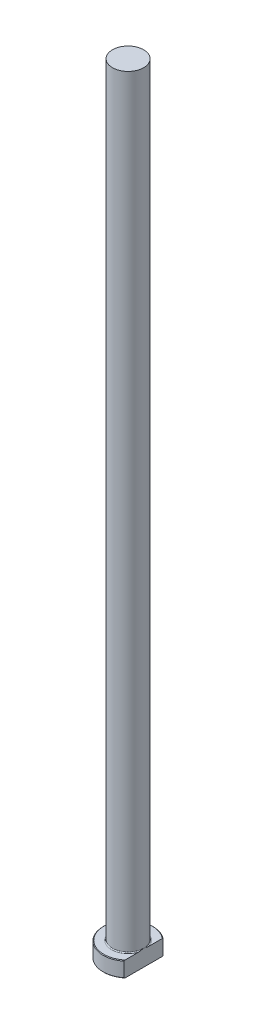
ISO-10303-21;
HEADER;
FILE_DESCRIPTION(('STEP AP214'),'2;1');
FILE_NAME('part.step','',(''),(''),'','','');
FILE_SCHEMA(('AUTOMOTIVE_DESIGN { 1 0 10303 214 1 1 1 1 }'));
ENDSEC;
DATA;
#1=APPLICATION_CONTEXT('core data for automotive mechanical design processes');
#2=APPLICATION_PROTOCOL_DEFINITION('international standard','automotive_design',2000,#1);
#3=PRODUCT_CONTEXT('',#1,'mechanical');
#4=PRODUCT('Part','Part','',(#3));
#5=PRODUCT_RELATED_PRODUCT_CATEGORY('part','',(#4));
#6=PRODUCT_DEFINITION_FORMATION('','',#4);
#7=PRODUCT_DEFINITION_CONTEXT('part definition',#1,'design');
#8=PRODUCT_DEFINITION('design','',#6,#7);
#9=PRODUCT_DEFINITION_SHAPE('','',#8);
#10=(LENGTH_UNIT() NAMED_UNIT(*) SI_UNIT(.MILLI.,.METRE.));
#11=(NAMED_UNIT(*) PLANE_ANGLE_UNIT() SI_UNIT($,.RADIAN.));
#12=(NAMED_UNIT(*) SI_UNIT($,.STERADIAN.) SOLID_ANGLE_UNIT());
#13=UNCERTAINTY_MEASURE_WITH_UNIT(LENGTH_MEASURE(1.E-05),#10,'distance_accuracy_value','');
#14=(GEOMETRIC_REPRESENTATION_CONTEXT(3) GLOBAL_UNCERTAINTY_ASSIGNED_CONTEXT((#13)) GLOBAL_UNIT_ASSIGNED_CONTEXT((#10,
#11,#12)) REPRESENTATION_CONTEXT('',''));
#15=CARTESIAN_POINT('',(0.,0.,0.));
#16=DIRECTION('',(0.,0.,1.));
#17=DIRECTION('',(1.,0.,0.));
#18=AXIS2_PLACEMENT_3D('',#15,#16,#17);
#19=CARTESIAN_POINT('',(0.,0.,0.));
#20=DIRECTION('',(0.,-1.,0.));
#21=DIRECTION('',(0.,0.,-1.));
#22=AXIS2_PLACEMENT_3D('',#19,#20,#21);
#23=PLANE('',#22);
#24=CARTESIAN_POINT('',(0.,0.,0.));
#25=DIRECTION('',(0.,-1.,0.));
#26=DIRECTION('',(0.,0.,-1.));
#27=AXIS2_PLACEMENT_3D('',#24,#25,#26);
#28=CIRCLE('',#27,7.79999999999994);
#29=CARTESIAN_POINT('',(4.99999999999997,0.,5.98665181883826));
#30=VERTEX_POINT('',#29);
#31=CARTESIAN_POINT('',(4.99999999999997,0.,-5.98665181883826));
#32=VERTEX_POINT('',#31);
#33=EDGE_CURVE('E98',#30,#32,#28,.T.);
#34=ORIENTED_EDGE('',*,*,#33,.T.);
#35=DIRECTION('',(0.,0.,1.));
#36=VECTOR('',#35,1.);
#37=CARTESIAN_POINT('',(4.99999999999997,0.,-6.24499799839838));
#38=LINE('',#37,#36);
#39=EDGE_CURVE('E83',#32,#30,#38,.T.);
#40=ORIENTED_EDGE('',*,*,#39,.T.);
#41=EDGE_LOOP('',(#34,#40));
#42=FACE_BOUND('',#41,.T.);
#43=ADVANCED_FACE('F32',(#42),#23,.T.);
#44=CARTESIAN_POINT('',(0.,259.958771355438,0.));
#45=DIRECTION('',(0.,1.,0.));
#46=DIRECTION('',(0.,0.,1.));
#47=AXIS2_PLACEMENT_3D('',#44,#45,#46);
#48=CYLINDRICAL_SURFACE('',#47,7.99999999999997);
#49=CARTESIAN_POINT('',(0.,4.80000000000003,0.));
#50=DIRECTION('',(0.,1.,0.));
#51=DIRECTION('',(0.,0.,1.));
#52=AXIS2_PLACEMENT_3D('',#49,#50,#51);
#53=CIRCLE('',#52,7.99999999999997);
#54=CARTESIAN_POINT('',(4.99999999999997,4.80000000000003,6.24499799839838));
#55=VERTEX_POINT('',#54);
#56=CARTESIAN_POINT('',(4.99999999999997,4.80000000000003,-6.24499799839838));
#57=VERTEX_POINT('',#56);
#58=EDGE_CURVE('E104',#55,#57,#53,.F.);
#59=ORIENTED_EDGE('',*,*,#58,.T.);
#60=DIRECTION('',(0.,-1.,0.));
#61=VECTOR('',#60,1.);
#62=CARTESIAN_POINT('',(4.99999999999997,250.,-6.24499799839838));
#63=LINE('',#62,#61);
#64=CARTESIAN_POINT('',(4.99999999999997,0.200000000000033,-6.24499799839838));
#65=VERTEX_POINT('',#64);
#66=EDGE_CURVE('E183',#57,#65,#63,.T.);
#67=ORIENTED_EDGE('',*,*,#66,.T.);
#68=CARTESIAN_POINT('',(0.,0.200000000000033,0.));
#69=DIRECTION('',(0.,-1.,0.));
#70=DIRECTION('',(0.,0.,-1.));
#71=AXIS2_PLACEMENT_3D('',#68,#69,#70);
#72=CIRCLE('',#71,7.99999999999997);
#73=CARTESIAN_POINT('',(4.99999999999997,0.200000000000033,6.24499799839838));
#74=VERTEX_POINT('',#73);
#75=EDGE_CURVE('E100',#65,#74,#72,.F.);
#76=ORIENTED_EDGE('',*,*,#75,.T.);
#77=DIRECTION('',(0.,-1.,0.));
#78=VECTOR('',#77,1.);
#79=CARTESIAN_POINT('',(4.99999999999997,250.,6.24499799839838));
#80=LINE('',#79,#78);
#81=EDGE_CURVE('E93',#55,#74,#80,.T.);
#82=ORIENTED_EDGE('',*,*,#81,.F.);
#83=EDGE_LOOP('',(#59,#67,#76,#82));
#84=FACE_BOUND('',#83,.T.);
#85=ADVANCED_FACE('F158',(#84),#48,.T.);
#86=CARTESIAN_POINT('',(-7.99999999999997,5.,0.));
#87=DIRECTION('',(0.,1.,0.));
#88=DIRECTION('',(0.,0.,1.));
#89=AXIS2_PLACEMENT_3D('',#86,#87,#88);
#90=PLANE('',#89);
#91=CARTESIAN_POINT('',(0.,5.,0.));
#92=DIRECTION('',(0.,1.,0.));
#93=DIRECTION('',(0.,0.,1.));
#94=AXIS2_PLACEMENT_3D('',#91,#92,#93);
#95=CIRCLE('',#94,7.79999999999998);
#96=CARTESIAN_POINT('',(4.99999999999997,5.,-5.9866518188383));
#97=VERTEX_POINT('',#96);
#98=CARTESIAN_POINT('',(4.99999999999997,5.,5.9866518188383));
#99=VERTEX_POINT('',#98);
#100=EDGE_CURVE('E178',#97,#99,#95,.T.);
#101=ORIENTED_EDGE('',*,*,#100,.T.);
#102=DIRECTION('',(0.,0.,-1.));
#103=VECTOR('',#102,1.);
#104=CARTESIAN_POINT('',(4.99999999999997,5.,0.));
#105=LINE('',#104,#103);
#106=CARTESIAN_POINT('',(4.99999999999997,4.99999999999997,1.75783958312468));
#107=VERTEX_POINT('',#106);
#108=EDGE_CURVE('E57',#99,#107,#105,.T.);
#109=ORIENTED_EDGE('',*,*,#108,.T.);
#110=CARTESIAN_POINT('',(0.,5.,0.));
#111=DIRECTION('',(0.,1.,0.));
#112=DIRECTION('',(0.,0.,1.));
#113=AXIS2_PLACEMENT_3D('',#110,#111,#112);
#114=CIRCLE('',#113,5.29999999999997);
#115=CARTESIAN_POINT('',(4.99999999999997,4.99999999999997,-1.75783958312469));
#116=VERTEX_POINT('',#115);
#117=EDGE_CURVE('E107',#107,#116,#114,.F.);
#118=ORIENTED_EDGE('',*,*,#117,.T.);
#119=EDGE_CURVE('E136',#116,#97,#105,.T.);
#120=ORIENTED_EDGE('',*,*,#119,.T.);
#121=EDGE_LOOP('',(#101,#109,#118,#120));
#122=FACE_BOUND('',#121,.T.);
#123=ADVANCED_FACE('F147',(#122),#90,.T.);
#124=CARTESIAN_POINT('',(0.,5.,0.));
#125=DIRECTION('',(0.,-1.,0.));
#126=DIRECTION('',(0.,0.,-1.));
#127=AXIS2_PLACEMENT_3D('',#124,#125,#126);
#128=CONICAL_SURFACE('',#127,7.79999999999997,0.785398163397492);
#129=ORIENTED_EDGE('',*,*,#58,.F.);
#130=CARTESIAN_POINT('',(4.99999999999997,-1.82162423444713,13.7401563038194));
#131=CARTESIAN_POINT('',(4.99999999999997,-1.61889813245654,13.5244204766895));
#132=CARTESIAN_POINT('',(4.99999999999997,-1.41646387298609,13.3084101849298));
#133=CARTESIAN_POINT('',(4.99999999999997,-1.01227657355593,12.8757508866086));
#134=CARTESIAN_POINT('',(4.99999999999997,-0.810523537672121,12.65910187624));
#135=CARTESIAN_POINT('',(4.99999999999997,-0.206157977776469,12.0077661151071));
#136=CARTESIAN_POINT('',(4.99999999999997,0.195280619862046,11.571988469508));
#137=CARTESIAN_POINT('',(4.99999999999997,1.00388282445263,10.6856136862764));
#138=CARTESIAN_POINT('',(4.99999999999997,1.41093902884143,10.234918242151));
#139=CARTESIAN_POINT('',(4.99999999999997,2.01658324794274,9.55471676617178));
#140=CARTESIAN_POINT('',(4.99999999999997,2.2175823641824,9.32735800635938));
#141=CARTESIAN_POINT('',(4.99999999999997,2.61761142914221,8.87091599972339));
#142=CARTESIAN_POINT('',(4.99999999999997,2.81664139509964,8.64183276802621));
#143=CARTESIAN_POINT('',(4.99999999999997,3.21217345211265,8.18170099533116));
#144=CARTESIAN_POINT('',(4.99999999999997,3.4086768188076,7.95065355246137));
#145=CARTESIAN_POINT('',(4.99999999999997,3.79865427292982,7.48599989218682));
#146=CARTESIAN_POINT('',(4.99999999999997,3.99212827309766,7.25239360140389));
#147=CARTESIAN_POINT('',(4.99999999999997,4.37558160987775,6.78155890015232));
#148=CARTESIAN_POINT('',(4.99999999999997,4.5655533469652,6.54432428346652));
#149=CARTESIAN_POINT('',(4.99999999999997,4.94042138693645,6.065895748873));
#150=CARTESIAN_POINT('',(4.99999999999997,5.12531810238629,5.82470215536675));
#151=CARTESIAN_POINT('',(4.99999999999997,5.48653546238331,5.33972956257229));
#152=CARTESIAN_POINT('',(4.99999999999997,5.6629239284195,5.09600137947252));
#153=CARTESIAN_POINT('',(4.99999999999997,6.00675382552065,4.60213647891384));
#154=CARTESIAN_POINT('',(4.99999999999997,6.17419169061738,4.35199726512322));
#155=CARTESIAN_POINT('',(4.99999999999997,6.49592993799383,3.84445040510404));
#156=CARTESIAN_POINT('',(4.99999999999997,6.65027272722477,3.5870701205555));
#157=CARTESIAN_POINT('',(4.99999999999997,6.86813414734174,3.19356592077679));
#158=CARTESIAN_POINT('',(4.99999999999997,6.93845533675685,3.06120993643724));
#159=CARTESIAN_POINT('',(4.99999999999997,7.07360441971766,2.7937331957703));
#160=CARTESIAN_POINT('',(4.99999999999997,7.13843319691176,2.65861288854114));
#161=CARTESIAN_POINT('',(4.99999999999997,7.26869642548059,2.3693638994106));
#162=CARTESIAN_POINT('',(4.99999999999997,7.33331212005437,2.21486278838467));
#163=CARTESIAN_POINT('',(4.99999999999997,7.45243473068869,1.90194073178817));
#164=CARTESIAN_POINT('',(4.99999999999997,7.50694001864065,1.74351915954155));
#165=CARTESIAN_POINT('',(4.99999999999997,7.60343746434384,1.42384276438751));
#166=CARTESIAN_POINT('',(4.99999999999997,7.64549910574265,1.26260921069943));
#167=CARTESIAN_POINT('',(4.99999999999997,7.71543089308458,0.937062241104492));
#168=CARTESIAN_POINT('',(4.99999999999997,7.74330266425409,0.772749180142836));
#169=CARTESIAN_POINT('',(4.99999999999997,7.78344284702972,0.439876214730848));
#170=CARTESIAN_POINT('',(4.99999999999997,7.79548961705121,0.27128901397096));
#171=CARTESIAN_POINT('',(4.99999999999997,7.80240809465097,-0.0662275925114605));
#172=CARTESIAN_POINT('',(4.99999999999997,7.79728142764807,-0.235156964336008));
#173=CARTESIAN_POINT('',(4.99999999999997,7.77017954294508,-0.572209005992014));
#174=CARTESIAN_POINT('',(4.99999999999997,7.74814735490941,-0.740327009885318));
#175=CARTESIAN_POINT('',(4.99999999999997,7.68863212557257,-1.07379849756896));
#176=CARTESIAN_POINT('',(4.99999999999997,7.65114437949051,-1.23915112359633));
#177=CARTESIAN_POINT('',(4.99999999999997,7.54734433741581,-1.62344926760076));
#178=CARTESIAN_POINT('',(4.99999999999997,7.47553580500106,-1.84089917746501));
#179=CARTESIAN_POINT('',(4.99999999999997,7.31300119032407,-2.26856946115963));
#180=CARTESIAN_POINT('',(4.99999999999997,7.22226460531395,-2.4787857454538));
#181=CARTESIAN_POINT('',(4.99999999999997,7.07492970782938,-2.79014067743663));
#182=CARTESIAN_POINT('',(4.99999999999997,7.0236227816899,-2.89384077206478));
#183=CARTESIAN_POINT('',(4.99999999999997,6.91783840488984,-3.0996162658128));
#184=CARTESIAN_POINT('',(4.99999999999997,6.86336091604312,-3.2016916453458));
#185=CARTESIAN_POINT('',(4.99999999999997,6.75169048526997,-3.40428995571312));
#186=CARTESIAN_POINT('',(4.99999999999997,6.69449856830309,-3.50481345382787));
#187=CARTESIAN_POINT('',(4.99999999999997,6.57774196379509,-3.70446206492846));
#188=CARTESIAN_POINT('',(4.99999999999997,6.51817739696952,-3.80358724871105));
#189=CARTESIAN_POINT('',(4.99999999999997,6.30853654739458,-4.1443576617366));
#190=CARTESIAN_POINT('',(4.99999999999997,6.15326588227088,-4.38281352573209));
#191=CARTESIAN_POINT('',(4.99999999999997,5.8337719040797,-4.85367607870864));
#192=CARTESIAN_POINT('',(4.99999999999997,5.66954595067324,-5.08608095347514));
#193=CARTESIAN_POINT('',(4.99999999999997,5.33431698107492,-5.54628554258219));
#194=CARTESIAN_POINT('',(4.99999999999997,5.16330740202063,-5.77408045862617));
#195=CARTESIAN_POINT('',(4.99999999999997,4.81629923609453,-6.22578157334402));
#196=CARTESIAN_POINT('',(4.99999999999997,4.64030119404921,-6.44968819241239));
#197=CARTESIAN_POINT('',(4.99999999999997,4.28368615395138,-6.89532578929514));
#198=CARTESIAN_POINT('',(4.99999999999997,4.10305289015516,-7.11704371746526));
#199=CARTESIAN_POINT('',(4.99999999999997,3.73870710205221,-7.55793799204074));
#200=CARTESIAN_POINT('',(4.99999999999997,3.55499450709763,-7.77711427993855));
#201=CARTESIAN_POINT('',(4.99999999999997,3.18521083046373,-8.21325328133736));
#202=CARTESIAN_POINT('',(4.99999999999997,2.99914113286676,-8.43021717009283));
#203=CARTESIAN_POINT('',(4.99999999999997,2.62499812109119,-8.86241167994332));
#204=CARTESIAN_POINT('',(4.99999999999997,2.43692478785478,-9.07764228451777));
#205=CARTESIAN_POINT('',(4.99999999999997,1.91463404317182,-9.67075518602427));
#206=CARTESIAN_POINT('',(4.99999999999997,1.57868086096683,-10.0471086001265));
#207=CARTESIAN_POINT('',(4.99999999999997,0.903003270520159,-10.7965122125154));
#208=CARTESIAN_POINT('',(4.99999999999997,0.563278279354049,-11.1695618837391));
#209=CARTESIAN_POINT('',(4.99999999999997,-0.116149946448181,-11.9100168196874));
#210=CARTESIAN_POINT('',(4.99999999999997,-0.455830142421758,-12.2774432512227));
#211=CARTESIAN_POINT('',(4.99999999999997,-1.13728640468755,-13.0102135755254));
#212=CARTESIAN_POINT('',(4.99999999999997,-1.47906204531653,-13.3755578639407));
#213=CARTESIAN_POINT('',(4.99999999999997,-1.82162423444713,-13.7401563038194));
#214=B_SPLINE_CURVE_WITH_KNOTS('',3,(#130,#131,#132,#133,#134,#135,#136,#137,#138,#139,#140,
#141,#142,#143,#144,#145,#146,#147,#148,#149,#150,#151,#152,#153,#154,#155,#156,#157,#158,#159,
#160,#161,#162,#163,#164,#165,#166,#167,#168,#169,#170,#171,#172,#173,#174,#175,#176,#177,#178,
#179,#180,#181,#182,#183,#184,#185,#186,#187,#188,#189,#190,#191,#192,#193,#194,#195,#196,#197,
#198,#199,#200,#201,#202,#203,#204,#205,#206,#207,#208,#209,#210,#211,#212,#213),.UNSPECIFIED.,
.F.,.F.,(4,2,2,2,2,2,2,2,2,2,2,2,2,2,2,2,2,2,2,2,2,2,2,2,2,2,2,2,2,2,2,2,2,2,2,2,2,2,2,2,2,4),
(0.,0.888120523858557,1.77624635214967,3.55372511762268,5.37559481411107,6.28598924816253,
7.19637570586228,8.10628289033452,9.01621623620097,9.92793449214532,10.8395784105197,
11.7420025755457,12.6447836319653,13.5445196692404,13.9940505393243,14.4435089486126,
14.9456212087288,15.4478142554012,15.947147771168,16.4464240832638,16.9526211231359,
17.4587702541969,17.966632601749,18.4746496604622,19.1604516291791,19.8466351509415,
20.1936870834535,20.5407431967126,20.8876692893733,21.2345777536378,22.0879097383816,
22.9414946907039,23.7959266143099,24.6502655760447,25.5081848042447,26.3661237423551,
27.2235803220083,28.0810450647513,29.5944656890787,31.1081235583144,32.6092678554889,
34.1101167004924),.UNSPECIFIED.);
#215=EDGE_CURVE('E135',#55,#99,#214,.T.);
#216=ORIENTED_EDGE('',*,*,#215,.T.);
#217=ORIENTED_EDGE('',*,*,#100,.F.);
#218=EDGE_CURVE('E127',#97,#57,#214,.T.);
#219=ORIENTED_EDGE('',*,*,#218,.T.);
#220=EDGE_LOOP('',(#129,#216,#217,#219));
#221=FACE_BOUND('',#220,.T.);
#222=ADVANCED_FACE('F143',(#221),#128,.T.);
#223=CARTESIAN_POINT('',(0.,0.200000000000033,0.));
#224=DIRECTION('',(0.,1.,0.));
#225=DIRECTION('',(0.,0.,1.));
#226=AXIS2_PLACEMENT_3D('',#223,#224,#225);
#227=CONICAL_SURFACE('',#226,7.99999999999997,0.785398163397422);
#228=ORIENTED_EDGE('',*,*,#75,.F.);
#229=CARTESIAN_POINT('',(4.99999999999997,6.8216242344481,-13.7401563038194));
#230=CARTESIAN_POINT('',(4.99999999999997,6.6188981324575,-13.5244204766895));
#231=CARTESIAN_POINT('',(4.99999999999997,6.41646387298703,-13.3084101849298));
#232=CARTESIAN_POINT('',(4.99999999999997,6.01227657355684,-12.8757508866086));
#233=CARTESIAN_POINT('',(4.99999999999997,5.81052353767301,-12.6591018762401));
#234=CARTESIAN_POINT('',(4.99999999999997,5.2061579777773,-12.0077661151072));
#235=CARTESIAN_POINT('',(4.99999999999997,4.80471938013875,-11.5719884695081));
#236=CARTESIAN_POINT('',(4.99999999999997,3.9961171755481,-10.6856136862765));
#237=CARTESIAN_POINT('',(4.99999999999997,3.58906097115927,-10.2349182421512));
#238=CARTESIAN_POINT('',(4.99999999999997,2.9834167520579,-9.55471676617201));
#239=CARTESIAN_POINT('',(4.99999999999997,2.78241763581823,-9.32735800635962));
#240=CARTESIAN_POINT('',(4.99999999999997,2.38238857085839,-8.87091599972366));
#241=CARTESIAN_POINT('',(4.99999999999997,2.18335860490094,-8.64183276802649));
#242=CARTESIAN_POINT('',(4.99999999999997,1.78782654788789,-8.18170099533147));
#243=CARTESIAN_POINT('',(4.99999999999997,1.59132318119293,-7.9506535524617));
#244=CARTESIAN_POINT('',(4.99999999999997,1.20134572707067,-7.48599989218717));
#245=CARTESIAN_POINT('',(4.99999999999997,1.00787172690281,-7.25239360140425));
#246=CARTESIAN_POINT('',(4.99999999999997,0.624418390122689,-6.78155890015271));
#247=CARTESIAN_POINT('',(4.99999999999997,0.434446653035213,-6.54432428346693));
#248=CARTESIAN_POINT('',(4.99999999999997,0.0595786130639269,-6.06589574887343));
#249=CARTESIAN_POINT('',(4.99999999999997,-0.125318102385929,-5.8247021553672));
#250=CARTESIAN_POINT('',(4.99999999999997,-0.486535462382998,-5.33972956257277));
#251=CARTESIAN_POINT('',(4.99999999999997,-0.662923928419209,-5.09600137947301));
#252=CARTESIAN_POINT('',(4.99999999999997,-1.0067538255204,-4.60213647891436));
#253=CARTESIAN_POINT('',(4.99999999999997,-1.17419169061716,-4.35199726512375));
#254=CARTESIAN_POINT('',(4.99999999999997,-1.49592993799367,-3.8444504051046));
#255=CARTESIAN_POINT('',(4.99999999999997,-1.65027272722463,-3.58707012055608));
#256=CARTESIAN_POINT('',(4.99999999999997,-1.86813414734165,-3.19356592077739));
#257=CARTESIAN_POINT('',(4.99999999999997,-1.93845533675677,-3.06120993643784));
#258=CARTESIAN_POINT('',(4.99999999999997,-2.07360441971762,-2.79373319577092));
#259=CARTESIAN_POINT('',(4.99999999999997,-2.13843319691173,-2.65861288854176));
#260=CARTESIAN_POINT('',(4.99999999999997,-2.2686964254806,-2.36936389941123));
#261=CARTESIAN_POINT('',(4.99999999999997,-2.3333121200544,-2.21486278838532));
#262=CARTESIAN_POINT('',(4.99999999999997,-2.45243473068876,-1.90194073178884));
#263=CARTESIAN_POINT('',(4.99999999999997,-2.50694001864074,-1.74351915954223));
#264=CARTESIAN_POINT('',(4.99999999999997,-2.60343746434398,-1.42384276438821));
#265=CARTESIAN_POINT('',(4.99999999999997,-2.64549910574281,-1.26260921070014));
#266=CARTESIAN_POINT('',(4.99999999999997,-2.7154308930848,-0.93706224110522));
#267=CARTESIAN_POINT('',(4.99999999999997,-2.74330266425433,-0.772749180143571));
#268=CARTESIAN_POINT('',(4.99999999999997,-2.78344284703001,-0.439876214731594));
#269=CARTESIAN_POINT('',(4.99999999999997,-2.79548961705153,-0.271289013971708));
#270=CARTESIAN_POINT('',(4.99999999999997,-2.80240809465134,0.0662275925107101));
#271=CARTESIAN_POINT('',(4.99999999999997,-2.79728142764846,0.235156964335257));
#272=CARTESIAN_POINT('',(4.99999999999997,-2.77017954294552,0.572209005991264));
#273=CARTESIAN_POINT('',(4.99999999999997,-2.74814735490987,0.740327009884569));
#274=CARTESIAN_POINT('',(4.99999999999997,-2.68863212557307,1.07379849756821));
#275=CARTESIAN_POINT('',(4.99999999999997,-2.65114437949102,1.23915112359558));
#276=CARTESIAN_POINT('',(4.99999999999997,-2.54734433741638,1.62344926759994));
#277=CARTESIAN_POINT('',(4.99999999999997,-2.47553580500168,1.84089917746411));
#278=CARTESIAN_POINT('',(4.99999999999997,-2.31300119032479,2.26856946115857));
#279=CARTESIAN_POINT('',(4.99999999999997,-2.22226460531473,2.47878574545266));
#280=CARTESIAN_POINT('',(4.99999999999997,-2.07492970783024,2.79014067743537));
#281=CARTESIAN_POINT('',(4.99999999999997,-2.02362278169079,2.89384077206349));
#282=CARTESIAN_POINT('',(4.99999999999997,-1.91783840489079,3.09961626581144));
#283=CARTESIAN_POINT('',(4.99999999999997,-1.8633609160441,3.20169164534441));
#284=CARTESIAN_POINT('',(4.99999999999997,-1.75169048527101,3.40428995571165));
#285=CARTESIAN_POINT('',(4.99999999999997,-1.69449856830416,3.50481345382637));
#286=CARTESIAN_POINT('',(4.99999999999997,-1.57774196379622,3.70446206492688));
#287=CARTESIAN_POINT('',(4.99999999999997,-1.51817739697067,3.80358724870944));
#288=CARTESIAN_POINT('',(4.99999999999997,-1.30853654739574,4.14435766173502));
#289=CARTESIAN_POINT('',(4.99999999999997,-1.15326588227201,4.38281352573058));
#290=CARTESIAN_POINT('',(4.99999999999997,-0.833771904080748,4.85367607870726));
#291=CARTESIAN_POINT('',(4.99999999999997,-0.669545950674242,5.08608095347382));
#292=CARTESIAN_POINT('',(4.99999999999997,-0.334316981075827,5.546285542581));
#293=CARTESIAN_POINT('',(4.99999999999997,-0.16330740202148,5.77408045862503));
#294=CARTESIAN_POINT('',(4.99999999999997,0.183700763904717,6.22578157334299));
#295=CARTESIAN_POINT('',(4.99999999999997,0.359698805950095,6.44968819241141));
#296=CARTESIAN_POINT('',(4.99999999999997,0.71631384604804,6.89532578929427));
#297=CARTESIAN_POINT('',(4.99999999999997,0.896947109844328,7.11704371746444));
#298=CARTESIAN_POINT('',(4.99999999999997,1.2612928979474,7.55793799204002));
#299=CARTESIAN_POINT('',(4.99999999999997,1.44500549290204,7.77711427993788));
#300=CARTESIAN_POINT('',(4.99999999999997,1.81478916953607,8.21325328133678));
#301=CARTESIAN_POINT('',(4.99999999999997,2.00085886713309,8.4302171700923));
#302=CARTESIAN_POINT('',(4.99999999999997,2.37500187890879,8.86241167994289));
#303=CARTESIAN_POINT('',(4.99999999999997,2.56307521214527,9.07764228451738));
#304=CARTESIAN_POINT('',(4.99999999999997,3.08536595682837,9.67075518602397));
#305=CARTESIAN_POINT('',(4.99999999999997,3.42131913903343,10.0471086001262));
#306=CARTESIAN_POINT('',(4.99999999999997,4.09699672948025,10.7965122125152));
#307=CARTESIAN_POINT('',(4.99999999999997,4.43672172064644,11.169561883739));
#308=CARTESIAN_POINT('',(4.99999999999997,5.11614994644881,11.9100168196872));
#309=CARTESIAN_POINT('',(4.99999999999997,5.45583014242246,12.2774432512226));
#310=CARTESIAN_POINT('',(4.99999999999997,6.13728640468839,13.0102135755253));
#311=CARTESIAN_POINT('',(4.99999999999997,6.47906204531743,13.3755578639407));
#312=CARTESIAN_POINT('',(4.99999999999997,6.8216242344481,13.7401563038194));
#313=B_SPLINE_CURVE_WITH_KNOTS('',3,(#229,#230,#231,#232,#233,#234,#235,#236,#237,#238,#239,
#240,#241,#242,#243,#244,#245,#246,#247,#248,#249,#250,#251,#252,#253,#254,#255,#256,#257,#258,
#259,#260,#261,#262,#263,#264,#265,#266,#267,#268,#269,#270,#271,#272,#273,#274,#275,#276,#277,
#278,#279,#280,#281,#282,#283,#284,#285,#286,#287,#288,#289,#290,#291,#292,#293,#294,#295,#296,
#297,#298,#299,#300,#301,#302,#303,#304,#305,#306,#307,#308,#309,#310,#311,#312),.UNSPECIFIED.,
.F.,.F.,(4,2,2,2,2,2,2,2,2,2,2,2,2,2,2,2,2,2,2,2,2,2,2,2,2,2,2,2,2,2,2,2,2,2,2,2,2,2,2,2,2,4),
(0.,0.888120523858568,1.77624635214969,3.55372511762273,5.37559481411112,6.28598924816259,
7.19637570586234,8.10628289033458,9.01621623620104,9.92793449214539,10.8395784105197,
11.7420025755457,12.6447836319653,13.5445196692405,13.9940505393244,14.4435089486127,
14.9456212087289,15.4478142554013,15.9471477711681,16.4464240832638,16.952621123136,
17.458770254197,17.9666326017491,18.4746496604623,19.1604516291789,19.846635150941,
20.1936870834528,20.5407431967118,20.8876692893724,21.2345777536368,22.0879097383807,
22.9414946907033,23.7959266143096,24.6502655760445,25.5081848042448,26.3661237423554,
27.2235803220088,28.0810450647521,29.5944656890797,31.1081235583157,32.6092678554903,
34.110116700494),.UNSPECIFIED.);
#314=EDGE_CURVE('E86',#65,#32,#313,.T.);
#315=ORIENTED_EDGE('',*,*,#314,.T.);
#316=ORIENTED_EDGE('',*,*,#33,.F.);
#317=EDGE_CURVE('E89',#30,#74,#313,.T.);
#318=ORIENTED_EDGE('',*,*,#317,.T.);
#319=EDGE_LOOP('',(#228,#315,#316,#318));
#320=FACE_BOUND('',#319,.T.);
#321=ADVANCED_FACE('F97',(#320),#227,.T.);
#322=CARTESIAN_POINT('',(0.,5.29999999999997,0.));
#323=DIRECTION('',(0.,1.,0.));
#324=DIRECTION('',(0.,0.,1.));
#325=AXIS2_PLACEMENT_3D('',#322,#323,#324);
#326=TOROIDAL_SURFACE('',#325,5.29999999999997,0.3);
#327=CARTESIAN_POINT('',(4.99999999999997,5.29999999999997,0.));
#328=CARTESIAN_POINT('',(4.99999999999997,5.30000062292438,1.31470000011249E-10));
#329=CARTESIAN_POINT('',(4.99999999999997,5.30000124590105,-2.52759208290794E-07));
#330=CARTESIAN_POINT('',(4.99999999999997,5.30000240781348,-9.4716432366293E-07));
#331=CARTESIAN_POINT('',(4.99999999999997,5.30000293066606,-1.40594035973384E-06));
#332=CARTESIAN_POINT('',(4.99999999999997,5.30000402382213,-2.50637603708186E-06));
#333=CARTESIAN_POINT('',(4.99999999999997,5.30000457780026,-3.16588904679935E-06));
#334=CARTESIAN_POINT('',(4.99999999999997,5.30000556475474,-4.52859961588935E-06));
#335=CARTESIAN_POINT('',(4.99999999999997,5.30000600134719,-5.22939444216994E-06));
#336=CARTESIAN_POINT('',(4.99999999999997,5.30000763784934,-7.96121978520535E-06));
#337=CARTESIAN_POINT('',(4.99999999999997,5.30000875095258,-1.0047740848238E-05));
#338=CARTESIAN_POINT('',(4.99999999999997,5.30001056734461,-1.41660873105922E-05));
#339=CARTESIAN_POINT('',(4.99999999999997,5.30001129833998,-1.61861783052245E-05));
#340=CARTESIAN_POINT('',(4.99999999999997,5.30001439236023,-2.47865739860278E-05));
#341=CARTESIAN_POINT('',(4.99999999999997,5.30001672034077,-3.1383028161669E-05));
#342=CARTESIAN_POINT('',(4.99999999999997,5.30002012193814,-4.38084218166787E-05));
#343=CARTESIAN_POINT('',(4.99999999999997,5.30002133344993,-4.95992736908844E-05));
#344=CARTESIAN_POINT('',(4.99999999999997,5.30003020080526,-9.27862610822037E-05));
#345=CARTESIAN_POINT('',(4.99999999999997,5.30003696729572,-0.000130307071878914));
#346=CARTESIAN_POINT('',(4.99999999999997,5.30006659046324,-0.000278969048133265));
#347=CARTESIAN_POINT('',(4.99999999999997,5.30009481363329,-0.000389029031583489));
#348=CARTESIAN_POINT('',(4.99999999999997,5.3002050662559,-0.000826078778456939));
#349=CARTESIAN_POINT('',(4.99999999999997,5.30028365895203,-0.0011536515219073));
#350=CARTESIAN_POINT('',(4.99999999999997,5.300599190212,-0.0024592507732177));
#351=CARTESIAN_POINT('',(4.99999999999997,5.30084048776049,-0.00343651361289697));
#352=CARTESIAN_POINT('',(4.99999999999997,5.3018462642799,-0.00752058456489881));
#353=CARTESIAN_POINT('',(4.99999999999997,5.3026052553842,-0.0106283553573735));
#354=CARTESIAN_POINT('',(4.99999999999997,5.30996461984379,-0.0407482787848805));
#355=CARTESIAN_POINT('',(4.99999999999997,5.31658985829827,-0.0677561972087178));
#356=CARTESIAN_POINT('',(4.99999999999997,5.32953319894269,-0.120688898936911));
#357=CARTESIAN_POINT('',(4.99999999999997,5.33585289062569,-0.146613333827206));
#358=CARTESIAN_POINT('',(4.99999999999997,5.34926050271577,-0.201795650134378));
#359=CARTESIAN_POINT('',(4.99999999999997,5.35634306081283,-0.231054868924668));
#360=CARTESIAN_POINT('',(4.99999999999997,5.37050252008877,-0.289917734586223));
#361=CARTESIAN_POINT('',(4.99999999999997,5.37757848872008,-0.319521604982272));
#362=CARTESIAN_POINT('',(4.99999999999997,5.39452602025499,-0.391032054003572));
#363=CARTESIAN_POINT('',(4.99999999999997,5.40434071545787,-0.432952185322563));
#364=CARTESIAN_POINT('',(4.99999999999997,5.42340141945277,-0.51576321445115));
#365=CARTESIAN_POINT('',(4.99999999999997,5.43265559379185,-0.556652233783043));
#366=CARTESIAN_POINT('',(4.99999999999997,5.45710553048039,-0.667075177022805));
#367=CARTESIAN_POINT('',(4.99999999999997,5.47194176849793,-0.736689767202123));
#368=CARTESIAN_POINT('',(4.99999999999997,5.50018229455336,-0.876836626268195));
#369=CARTESIAN_POINT('',(4.99999999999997,5.51357312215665,-0.947371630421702));
#370=CARTESIAN_POINT('',(4.99999999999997,5.53930921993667,-1.09497328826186));
#371=CARTESIAN_POINT('',(4.99999999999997,5.55146217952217,-1.17207432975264));
#372=CARTESIAN_POINT('',(4.99999999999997,5.57239669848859,-1.32672649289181));
#373=CARTESIAN_POINT('',(4.99999999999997,5.58117877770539,-1.40427754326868));
#374=CARTESIAN_POINT('',(4.99999999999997,5.594997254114,-1.5687382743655));
#375=CARTESIAN_POINT('',(4.99999999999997,5.59948802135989,-1.65570044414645));
#376=CARTESIAN_POINT('',(4.99999999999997,5.60018885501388,-1.78535304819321));
#377=CARTESIAN_POINT('',(4.99999999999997,5.59945214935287,-1.82802575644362));
#378=CARTESIAN_POINT('',(4.99999999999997,5.59559364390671,-1.91325081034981));
#379=CARTESIAN_POINT('',(4.99999999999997,5.59247319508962,-1.95580321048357));
#380=CARTESIAN_POINT('',(4.99999999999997,5.5838324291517,-2.03512365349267));
#381=CARTESIAN_POINT('',(4.99999999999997,5.57867386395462,-2.07192937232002));
#382=CARTESIAN_POINT('',(4.99999999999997,5.56543793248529,-2.1452675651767));
#383=CARTESIAN_POINT('',(4.99999999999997,5.55734203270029,-2.18179676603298));
#384=CARTESIAN_POINT('',(4.99999999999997,5.53718005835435,-2.25427226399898));
#385=CARTESIAN_POINT('',(4.99999999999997,5.52507057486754,-2.29020746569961));
#386=CARTESIAN_POINT('',(4.99999999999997,5.50270928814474,-2.34223029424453));
#387=CARTESIAN_POINT('',(4.99999999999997,5.4945781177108,-2.35922314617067));
#388=CARTESIAN_POINT('',(4.99999999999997,5.47657809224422,-2.39224900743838));
#389=CARTESIAN_POINT('',(4.99999999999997,5.46671281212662,-2.40828390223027));
#390=CARTESIAN_POINT('',(4.99999999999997,5.44695893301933,-2.43579467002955));
#391=CARTESIAN_POINT('',(4.99999999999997,5.4374587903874,-2.44754592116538));
#392=CARTESIAN_POINT('',(4.99999999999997,5.41677914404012,-2.46946476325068));
#393=CARTESIAN_POINT('',(4.99999999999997,5.40560543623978,-2.47963758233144));
#394=CARTESIAN_POINT('',(4.99999999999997,5.38617750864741,-2.49393642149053));
#395=CARTESIAN_POINT('',(4.99999999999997,5.37851643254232,-2.49886271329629));
#396=CARTESIAN_POINT('',(4.99999999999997,5.36252740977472,-2.50749953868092));
#397=CARTESIAN_POINT('',(4.99999999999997,5.35419984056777,-2.51121075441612));
#398=CARTESIAN_POINT('',(4.99999999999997,5.33690648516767,-2.51712941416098));
#399=CARTESIAN_POINT('',(4.99999999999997,5.3279345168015,-2.51931927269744));
#400=CARTESIAN_POINT('',(4.99999999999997,5.30973576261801,-2.52185978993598));
#401=CARTESIAN_POINT('',(4.99999999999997,5.30050931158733,-2.52221275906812));
#402=CARTESIAN_POINT('',(4.99999999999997,5.28349166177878,-2.52112455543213));
#403=CARTESIAN_POINT('',(4.99999999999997,5.27568322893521,-2.519931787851));
#404=CARTESIAN_POINT('',(4.99999999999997,5.26036860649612,-2.51628294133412));
#405=CARTESIAN_POINT('',(4.99999999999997,5.25286261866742,-2.51382603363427));
#406=CARTESIAN_POINT('',(4.99999999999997,5.23590266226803,-2.50685484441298));
#407=CARTESIAN_POINT('',(4.99999999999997,5.22661875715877,-2.50192984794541));
#408=CARTESIAN_POINT('',(4.99999999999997,5.20895514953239,-2.49066548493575));
#409=CARTESIAN_POINT('',(4.99999999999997,5.20057756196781,-2.48432291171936));
#410=CARTESIAN_POINT('',(4.99999999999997,5.1798700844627,-2.46645212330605));
#411=CARTESIAN_POINT('',(4.99999999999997,5.1682415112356,-2.45411867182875));
#412=CARTESIAN_POINT('',(4.99999999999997,5.14692461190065,-2.42790849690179));
#413=CARTESIAN_POINT('',(4.99999999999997,5.13723987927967,-2.41402898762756));
#414=CARTESIAN_POINT('',(4.99999999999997,5.11080706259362,-2.37143175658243));
#415=CARTESIAN_POINT('',(4.99999999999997,5.09628770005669,-2.34134703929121));
#416=CARTESIAN_POINT('',(4.99999999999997,5.07130349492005,-2.27940731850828));
#417=CARTESIAN_POINT('',(4.99999999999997,5.06087110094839,-2.24754035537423));
#418=CARTESIAN_POINT('',(4.99999999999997,5.03890359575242,-2.16787245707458));
#419=CARTESIAN_POINT('',(4.99999999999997,5.02913523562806,-2.1195906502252));
#420=CARTESIAN_POINT('',(4.99999999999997,5.01416953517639,-2.02224928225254));
#421=CARTESIAN_POINT('',(4.99999999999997,5.00898637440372,-1.97318778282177));
#422=CARTESIAN_POINT('',(4.99999999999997,5.00220823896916,-1.87635767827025));
#423=CARTESIAN_POINT('',(4.99999999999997,5.00050709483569,-1.82859609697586));
#424=CARTESIAN_POINT('',(4.99999999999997,4.99969104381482,-1.73330165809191));
#425=CARTESIAN_POINT('',(4.99999999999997,5.00056327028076,-1.68576884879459));
#426=CARTESIAN_POINT('',(4.99999999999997,5.0048429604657,-1.57937770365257));
#427=CARTESIAN_POINT('',(4.99999999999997,5.00880932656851,-1.52054285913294));
#428=CARTESIAN_POINT('',(4.99999999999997,5.01925964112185,-1.40312974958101));
#429=CARTESIAN_POINT('',(4.99999999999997,5.02574264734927,-1.34455139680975));
#430=CARTESIAN_POINT('',(4.99999999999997,5.04090087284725,-1.22627662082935));
#431=CARTESIAN_POINT('',(4.99999999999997,5.0496242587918,-1.16658647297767));
#432=CARTESIAN_POINT('',(4.99999999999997,5.06877923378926,-1.04732463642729));
#433=CARTESIAN_POINT('',(4.99999999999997,5.07921523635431,-0.987753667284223));
#434=CARTESIAN_POINT('',(4.99999999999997,5.10551698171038,-0.846936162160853));
#435=CARTESIAN_POINT('',(4.99999999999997,5.12196565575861,-0.765799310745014));
#436=CARTESIAN_POINT('',(4.99999999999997,5.15639716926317,-0.604819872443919));
#437=CARTESIAN_POINT('',(4.99999999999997,5.17436050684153,-0.524973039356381));
#438=CARTESIAN_POINT('',(4.99999999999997,5.20921667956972,-0.374726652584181));
#439=CARTESIAN_POINT('',(4.99999999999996,5.22599388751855,-0.304300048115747));
#440=CARTESIAN_POINT('',(4.99999999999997,5.2519110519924,-0.196907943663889));
#441=CARTESIAN_POINT('',(4.99999999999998,5.26090146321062,-0.159905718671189));
#442=CARTESIAN_POINT('',(4.99999999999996,5.27881854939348,-0.0865164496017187));
#443=CARTESIAN_POINT('',(4.99999999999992,5.28774391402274,-0.0501291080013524));
#444=CARTESIAN_POINT('',(4.99999999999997,5.29739627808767,-0.0106218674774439));
#445=CARTESIAN_POINT('',(4.99999999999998,5.2981568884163,-0.00750762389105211));
#446=CARTESIAN_POINT('',(4.99999999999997,5.2991630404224,-0.00342209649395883));
#447=CARTESIAN_POINT('',(4.99999999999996,5.29940309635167,-0.00244985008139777));
#448=CARTESIAN_POINT('',(4.99999999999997,5.29971711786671,-0.00115049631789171));
#449=CARTESIAN_POINT('',(4.99999999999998,5.299795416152,-0.000824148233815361));
#450=CARTESIAN_POINT('',(4.99999999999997,5.2999053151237,-0.000388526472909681));
#451=CARTESIAN_POINT('',(4.99999999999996,5.29993348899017,-0.0002786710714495));
#452=CARTESIAN_POINT('',(4.99999999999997,5.29996306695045,-0.000130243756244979));
#453=CARTESIAN_POINT('',(4.99999999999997,5.29996982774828,-9.2751137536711E-05));
#454=CARTESIAN_POINT('',(4.99999999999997,5.29997868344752,-4.95929887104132E-05));
#455=CARTESIAN_POINT('',(4.99999999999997,5.29997989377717,-4.38036553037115E-05));
#456=CARTESIAN_POINT('',(4.99999999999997,5.29998329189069,-3.13814183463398E-05));
#457=CARTESIAN_POINT('',(4.99999999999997,5.29998561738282,-2.4786521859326E-05));
#458=CARTESIAN_POINT('',(4.99999999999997,5.29998870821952,-1.61877546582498E-05));
#459=CARTESIAN_POINT('',(4.99999999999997,5.29998943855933,-1.41677768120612E-05));
#460=CARTESIAN_POINT('',(4.99999999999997,5.29999125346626,-1.00495530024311E-05));
#461=CARTESIAN_POINT('',(4.99999999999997,5.29999236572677,-7.96302653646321E-06));
#462=CARTESIAN_POINT('',(4.99999999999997,5.29999400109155,-5.23107415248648E-06));
#463=CARTESIAN_POINT('',(4.99999999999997,5.29999443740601,-4.53021031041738E-06));
#464=CARTESIAN_POINT('',(4.99999999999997,5.29999542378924,-3.16731152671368E-06));
#465=CARTESIAN_POINT('',(4.99999999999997,5.29999597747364,-2.50767725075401E-06));
#466=CARTESIAN_POINT('',(4.99999999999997,5.29999707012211,-1.40695877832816E-06));
#467=CARTESIAN_POINT('',(4.99999999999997,5.29999759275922,-9.48032431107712E-07));
#468=CARTESIAN_POINT('',(4.99999999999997,5.29999875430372,-2.53244317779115E-07));
#469=CARTESIAN_POINT('',(4.99999999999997,5.29999937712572,-1.3145941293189E-10));
#470=CARTESIAN_POINT('',(4.99999999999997,5.29999999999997,0.));
#471=B_SPLINE_CURVE_WITH_KNOTS('',3,(#327,#328,#329,#330,#331,#332,#333,#334,#335,#336,#337,
#338,#339,#340,#341,#342,#343,#344,#345,#346,#347,#348,#349,#350,#351,#352,#353,#354,#355,#356,
#357,#358,#359,#360,#361,#362,#363,#364,#365,#366,#367,#368,#369,#370,#371,#372,#373,#374,#375,
#376,#377,#378,#379,#380,#381,#382,#383,#384,#385,#386,#387,#388,#389,#390,#391,#392,#393,#394,
#395,#396,#397,#398,#399,#400,#401,#402,#403,#404,#405,#406,#407,#408,#409,#410,#411,#412,#413,
#414,#415,#416,#417,#418,#419,#420,#421,#422,#423,#424,#425,#426,#427,#428,#429,#430,#431,#432,
#433,#434,#435,#436,#437,#438,#439,#440,#441,#442,#443,#444,#445,#446,#447,#448,#449,#450,#451,
#452,#453,#454,#455,#456,#457,#458,#459,#460,#461,#462,#463,#464,#465,#466,#467,#468,#469,#470),
.UNSPECIFIED.,.T.,.F.,(4,2,2,2,2,2,2,2,2,2,2,2,2,2,2,2,2,2,2,2,2,2,2,2,2,2,2,2,2,2,2,2,2,2,2,2,
2,2,2,2,2,2,2,2,2,2,2,2,2,2,2,2,2,2,2,2,2,2,2,2,2,2,2,2,2,2,2,2,2,2,2,4),(0.,
1.88939317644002E-06,3.98058917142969E-06,6.54818564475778E-06,9.0240439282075E-06,
1.60938750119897E-05,2.25328198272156E-05,4.34843921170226E-05,6.12120199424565E-05,
0.000175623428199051,0.000516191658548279,0.00152710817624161,0.00454656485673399,
0.0141443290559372,0.0975679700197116,0.177619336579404,0.267931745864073,0.35924502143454,
0.488405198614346,0.614173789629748,0.827694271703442,1.04305715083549,1.27715608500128,
1.51121890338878,1.77214751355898,1.9001350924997,2.02805018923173,2.13945459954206,
2.25157451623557,2.36494894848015,2.4213923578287,2.47772074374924,2.52293802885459,
2.56800219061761,2.59524342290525,2.62246933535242,2.65000494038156,2.67750590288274,
2.70108948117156,2.72468854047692,2.75603978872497,2.78746268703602,2.83802806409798,
2.888686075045,2.98834295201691,3.0887757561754,3.23618650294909,3.38405153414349,
3.52733651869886,3.66990630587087,3.84673903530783,4.02350562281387,4.20444776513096,
4.38586374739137,4.63419556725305,4.87971270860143,5.09690175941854,5.21113882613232,
5.32353360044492,5.33315137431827,5.33615533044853,5.33716246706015,5.33750240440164,
5.33761672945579,5.33763445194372,5.33765539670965,5.33766183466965,5.33766890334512,
5.33767137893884,5.3376739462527,5.33767603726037,5.3376779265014),.UNSPECIFIED.);
#472=CARTESIAN_POINT('',(4.99999999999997,5.29999999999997,0.));
#473=VERTEX_POINT('',#472);
#474=EDGE_CURVE('E11',#116,#473,#471,.T.);
#475=ORIENTED_EDGE('',*,*,#474,.F.);
#476=ORIENTED_EDGE('',*,*,#117,.F.);
#477=CARTESIAN_POINT('',(4.99999999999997,5.29999999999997,0.));
#478=CARTESIAN_POINT('',(4.99999999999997,5.29999937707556,-1.31470067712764E-10));
#479=CARTESIAN_POINT('',(4.99999999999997,5.29999875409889,2.5275920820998E-07));
#480=CARTESIAN_POINT('',(4.99999999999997,5.29999759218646,9.4716432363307E-07));
#481=CARTESIAN_POINT('',(4.99999999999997,5.29999706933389,1.40594035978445E-06));
#482=CARTESIAN_POINT('',(4.99999999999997,5.29999597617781,2.5063760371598E-06));
#483=CARTESIAN_POINT('',(4.99999999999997,5.29999542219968,3.16588904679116E-06));
#484=CARTESIAN_POINT('',(4.99999999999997,5.2999944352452,4.52859961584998E-06));
#485=CARTESIAN_POINT('',(4.99999999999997,5.29999399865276,5.22939444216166E-06));
#486=CARTESIAN_POINT('',(4.99999999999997,5.2999923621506,7.96121978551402E-06));
#487=CARTESIAN_POINT('',(4.99999999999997,5.29999124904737,1.00477408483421E-05));
#488=CARTESIAN_POINT('',(4.99999999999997,5.29998943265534,1.41660873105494E-05));
#489=CARTESIAN_POINT('',(4.99999999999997,5.29998870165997,1.61861783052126E-05));
#490=CARTESIAN_POINT('',(4.99999999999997,5.29998560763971,2.47865739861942E-05));
#491=CARTESIAN_POINT('',(4.99999999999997,5.29998327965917,3.13830281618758E-05));
#492=CARTESIAN_POINT('',(4.99999999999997,5.2999798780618,4.38084218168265E-05));
#493=CARTESIAN_POINT('',(4.99999999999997,5.29997866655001,4.95992736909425E-05));
#494=CARTESIAN_POINT('',(4.99999999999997,5.29996979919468,9.27862610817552E-05));
#495=CARTESIAN_POINT('',(4.99999999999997,5.29996303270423,0.000130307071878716));
#496=CARTESIAN_POINT('',(4.99999999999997,5.2999334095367,0.000278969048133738));
#497=CARTESIAN_POINT('',(4.99999999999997,5.29990518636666,0.000389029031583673));
#498=CARTESIAN_POINT('',(4.99999999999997,5.29979493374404,0.000826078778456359));
#499=CARTESIAN_POINT('',(4.99999999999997,5.29971634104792,0.00115365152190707));
#500=CARTESIAN_POINT('',(4.99999999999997,5.29940080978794,0.00245925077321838));
#501=CARTESIAN_POINT('',(4.99999999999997,5.29915951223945,0.00343651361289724));
#502=CARTESIAN_POINT('',(4.99999999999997,5.29815373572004,0.00752058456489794));
#503=CARTESIAN_POINT('',(4.99999999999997,5.29739474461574,0.0106283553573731));
#504=CARTESIAN_POINT('',(4.99999999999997,5.29003538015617,0.040748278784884));
#505=CARTESIAN_POINT('',(4.99999999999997,5.28341014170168,0.0677561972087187));
#506=CARTESIAN_POINT('',(4.99999999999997,5.27046680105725,0.12068889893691));
#507=CARTESIAN_POINT('',(4.99999999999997,5.26414710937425,0.146613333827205));
#508=CARTESIAN_POINT('',(4.99999999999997,5.25073949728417,0.201795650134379));
#509=CARTESIAN_POINT('',(4.99999999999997,5.24365693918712,0.231054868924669));
#510=CARTESIAN_POINT('',(4.99999999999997,5.22949747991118,0.289917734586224));
#511=CARTESIAN_POINT('',(4.99999999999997,5.22242151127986,0.319521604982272));
#512=CARTESIAN_POINT('',(4.99999999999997,5.20547397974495,0.391032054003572));
#513=CARTESIAN_POINT('',(4.99999999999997,5.19565928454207,0.432952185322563));
#514=CARTESIAN_POINT('',(4.99999999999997,5.17659858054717,0.51576321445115));
#515=CARTESIAN_POINT('',(4.99999999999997,5.16734440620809,0.556652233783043));
#516=CARTESIAN_POINT('',(4.99999999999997,5.14289446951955,0.667075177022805));
#517=CARTESIAN_POINT('',(4.99999999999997,5.12805823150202,0.736689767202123));
#518=CARTESIAN_POINT('',(4.99999999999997,5.09981770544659,0.876836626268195));
#519=CARTESIAN_POINT('',(4.99999999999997,5.08642687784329,0.947371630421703));
#520=CARTESIAN_POINT('',(4.99999999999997,5.06069078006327,1.09497328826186));
#521=CARTESIAN_POINT('',(4.99999999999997,5.04853782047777,1.17207432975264));
#522=CARTESIAN_POINT('',(4.99999999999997,5.02760330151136,1.32672649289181));
#523=CARTESIAN_POINT('',(4.99999999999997,5.01882122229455,1.40427754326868));
#524=CARTESIAN_POINT('',(4.99999999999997,5.00500274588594,1.5687382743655));
#525=CARTESIAN_POINT('',(4.99999999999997,5.00051197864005,1.65570044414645));
#526=CARTESIAN_POINT('',(4.99999999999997,4.99981114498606,1.78535304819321));
#527=CARTESIAN_POINT('',(4.99999999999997,5.00054785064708,1.82802575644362));
#528=CARTESIAN_POINT('',(4.99999999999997,5.00440635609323,1.91325081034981));
#529=CARTESIAN_POINT('',(4.99999999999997,5.00752680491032,1.95580321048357));
#530=CARTESIAN_POINT('',(4.99999999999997,5.01616757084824,2.03512365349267));
#531=CARTESIAN_POINT('',(4.99999999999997,5.02132613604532,2.07192937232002));
#532=CARTESIAN_POINT('',(4.99999999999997,5.03456206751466,2.1452675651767));
#533=CARTESIAN_POINT('',(4.99999999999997,5.04265796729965,2.18179676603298));
#534=CARTESIAN_POINT('',(4.99999999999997,5.0628199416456,2.25427226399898));
#535=CARTESIAN_POINT('',(4.99999999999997,5.0749294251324,2.29020746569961));
#536=CARTESIAN_POINT('',(4.99999999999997,5.09729071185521,2.34223029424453));
#537=CARTESIAN_POINT('',(4.99999999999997,5.10542188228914,2.35922314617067));
#538=CARTESIAN_POINT('',(4.99999999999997,5.12342190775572,2.39224900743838));
#539=CARTESIAN_POINT('',(4.99999999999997,5.13328718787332,2.40828390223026));
#540=CARTESIAN_POINT('',(4.99999999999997,5.15304106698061,2.43579467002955));
#541=CARTESIAN_POINT('',(4.99999999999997,5.16254120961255,2.44754592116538));
#542=CARTESIAN_POINT('',(4.99999999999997,5.18322085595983,2.46946476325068));
#543=CARTESIAN_POINT('',(4.99999999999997,5.19439456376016,2.47963758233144));
#544=CARTESIAN_POINT('',(4.99999999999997,5.21382249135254,2.49393642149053));
#545=CARTESIAN_POINT('',(4.99999999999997,5.22148356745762,2.49886271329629));
#546=CARTESIAN_POINT('',(4.99999999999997,5.23747259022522,2.50749953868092));
#547=CARTESIAN_POINT('',(4.99999999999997,5.24580015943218,2.51121075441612));
#548=CARTESIAN_POINT('',(4.99999999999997,5.26309351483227,2.51712941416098));
#549=CARTESIAN_POINT('',(4.99999999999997,5.27206548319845,2.51931927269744));
#550=CARTESIAN_POINT('',(4.99999999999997,5.29026423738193,2.52185978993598));
#551=CARTESIAN_POINT('',(4.99999999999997,5.29949068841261,2.52221275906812));
#552=CARTESIAN_POINT('',(4.99999999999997,5.31650833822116,2.52112455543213));
#553=CARTESIAN_POINT('',(4.99999999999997,5.32431677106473,2.519931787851));
#554=CARTESIAN_POINT('',(4.99999999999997,5.33963139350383,2.51628294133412));
#555=CARTESIAN_POINT('',(4.99999999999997,5.34713738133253,2.51382603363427));
#556=CARTESIAN_POINT('',(4.99999999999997,5.36409733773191,2.50685484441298));
#557=CARTESIAN_POINT('',(4.99999999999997,5.37338124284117,2.50192984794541));
#558=CARTESIAN_POINT('',(4.99999999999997,5.39104485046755,2.49066548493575));
#559=CARTESIAN_POINT('',(4.99999999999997,5.39942243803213,2.48432291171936));
#560=CARTESIAN_POINT('',(4.99999999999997,5.42012991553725,2.46645212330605));
#561=CARTESIAN_POINT('',(4.99999999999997,5.43175848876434,2.45411867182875));
#562=CARTESIAN_POINT('',(4.99999999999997,5.45307538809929,2.42790849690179));
#563=CARTESIAN_POINT('',(4.99999999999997,5.46276012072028,2.41402898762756));
#564=CARTESIAN_POINT('',(4.99999999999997,5.48919293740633,2.37143175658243));
#565=CARTESIAN_POINT('',(4.99999999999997,5.50371229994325,2.34134703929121));
#566=CARTESIAN_POINT('',(4.99999999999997,5.52869650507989,2.27940731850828));
#567=CARTESIAN_POINT('',(4.99999999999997,5.53912889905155,2.24754035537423));
#568=CARTESIAN_POINT('',(4.99999999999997,5.56109640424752,2.16787245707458));
#569=CARTESIAN_POINT('',(4.99999999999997,5.57086476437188,2.1195906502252));
#570=CARTESIAN_POINT('',(4.99999999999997,5.58583046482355,2.02224928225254));
#571=CARTESIAN_POINT('',(4.99999999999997,5.59101362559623,1.97318778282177));
#572=CARTESIAN_POINT('',(4.99999999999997,5.59779176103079,1.87635767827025));
#573=CARTESIAN_POINT('',(4.99999999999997,5.59949290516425,1.82859609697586));
#574=CARTESIAN_POINT('',(4.99999999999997,5.60030895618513,1.73330165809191));
#575=CARTESIAN_POINT('',(4.99999999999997,5.59943672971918,1.68576884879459));
#576=CARTESIAN_POINT('',(4.99999999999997,5.59515703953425,1.57937770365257));
#577=CARTESIAN_POINT('',(4.99999999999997,5.59119067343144,1.52054285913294));
#578=CARTESIAN_POINT('',(4.99999999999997,5.5807403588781,1.40312974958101));
#579=CARTESIAN_POINT('',(4.99999999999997,5.57425735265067,1.34455139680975));
#580=CARTESIAN_POINT('',(4.99999999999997,5.5590991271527,1.22627662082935));
#581=CARTESIAN_POINT('',(4.99999999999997,5.55037574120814,1.16658647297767));
#582=CARTESIAN_POINT('',(4.99999999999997,5.53122076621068,1.04732463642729));
#583=CARTESIAN_POINT('',(4.99999999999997,5.52078476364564,0.987753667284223));
#584=CARTESIAN_POINT('',(4.99999999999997,5.49448301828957,0.846936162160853));
#585=CARTESIAN_POINT('',(4.99999999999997,5.47803434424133,0.765799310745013));
#586=CARTESIAN_POINT('',(4.99999999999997,5.44360283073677,0.604819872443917));
#587=CARTESIAN_POINT('',(4.99999999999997,5.42563949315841,0.52497303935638));
#588=CARTESIAN_POINT('',(4.99999999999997,5.39078332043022,0.374726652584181));
#589=CARTESIAN_POINT('',(4.99999999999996,5.37400611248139,0.304300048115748));
#590=CARTESIAN_POINT('',(4.99999999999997,5.34808894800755,0.19690794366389));
#591=CARTESIAN_POINT('',(4.99999999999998,5.33909853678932,0.159905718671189));
#592=CARTESIAN_POINT('',(4.99999999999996,5.32118145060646,0.0865164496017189));
#593=CARTESIAN_POINT('',(4.99999999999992,5.31225608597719,0.0501291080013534));
#594=CARTESIAN_POINT('',(4.99999999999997,5.30260372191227,0.0106218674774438));
#595=CARTESIAN_POINT('',(4.99999999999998,5.30184311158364,0.00750762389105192));
#596=CARTESIAN_POINT('',(4.99999999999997,5.30083695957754,0.00342209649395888));
#597=CARTESIAN_POINT('',(4.99999999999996,5.30059690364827,0.00244985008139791));
#598=CARTESIAN_POINT('',(4.99999999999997,5.30028288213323,0.00115049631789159));
#599=CARTESIAN_POINT('',(4.99999999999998,5.30020458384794,0.000824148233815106));
#600=CARTESIAN_POINT('',(4.99999999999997,5.30009468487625,0.000388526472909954));
#601=CARTESIAN_POINT('',(4.99999999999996,5.30006651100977,0.000278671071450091));
#602=CARTESIAN_POINT('',(4.99999999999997,5.30003693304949,0.000130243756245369));
#603=CARTESIAN_POINT('',(4.99999999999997,5.30003017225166,9.27511375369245E-05));
#604=CARTESIAN_POINT('',(4.99999999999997,5.30002131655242,4.95929887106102E-05));
#605=CARTESIAN_POINT('',(4.99999999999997,5.30002010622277,4.38036553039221E-05));
#606=CARTESIAN_POINT('',(4.99999999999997,5.30001670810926,3.13814183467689E-05));
#607=CARTESIAN_POINT('',(4.99999999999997,5.30001438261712,2.47865218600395E-05));
#608=CARTESIAN_POINT('',(4.99999999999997,5.30001129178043,1.61877546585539E-05));
#609=CARTESIAN_POINT('',(4.99999999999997,5.30001056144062,1.41677768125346E-05));
#610=CARTESIAN_POINT('',(4.99999999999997,5.30000874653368,1.00495530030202E-05));
#611=CARTESIAN_POINT('',(4.99999999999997,5.30000763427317,7.96302653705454E-06));
#612=CARTESIAN_POINT('',(4.99999999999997,5.30000599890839,5.23107415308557E-06));
#613=CARTESIAN_POINT('',(4.99999999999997,5.30000556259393,4.53021031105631E-06));
#614=CARTESIAN_POINT('',(4.99999999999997,5.30000457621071,3.16731152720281E-06));
#615=CARTESIAN_POINT('',(4.99999999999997,5.3000040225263,2.50767725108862E-06));
#616=CARTESIAN_POINT('',(4.99999999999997,5.30000292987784,1.40695877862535E-06));
#617=CARTESIAN_POINT('',(4.99999999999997,5.30000240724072,9.48032431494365E-07));
#618=CARTESIAN_POINT('',(4.99999999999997,5.30000124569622,2.53244318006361E-07));
#619=CARTESIAN_POINT('',(4.99999999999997,5.30000062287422,1.31459480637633E-10));
#620=CARTESIAN_POINT('',(4.99999999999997,5.29999999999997,0.));
#621=B_SPLINE_CURVE_WITH_KNOTS('',3,(#477,#478,#479,#480,#481,#482,#483,#484,#485,#486,#487,
#488,#489,#490,#491,#492,#493,#494,#495,#496,#497,#498,#499,#500,#501,#502,#503,#504,#505,#506,
#507,#508,#509,#510,#511,#512,#513,#514,#515,#516,#517,#518,#519,#520,#521,#522,#523,#524,#525,
#526,#527,#528,#529,#530,#531,#532,#533,#534,#535,#536,#537,#538,#539,#540,#541,#542,#543,#544,
#545,#546,#547,#548,#549,#550,#551,#552,#553,#554,#555,#556,#557,#558,#559,#560,#561,#562,#563,
#564,#565,#566,#567,#568,#569,#570,#571,#572,#573,#574,#575,#576,#577,#578,#579,#580,#581,#582,
#583,#584,#585,#586,#587,#588,#589,#590,#591,#592,#593,#594,#595,#596,#597,#598,#599,#600,#601,
#602,#603,#604,#605,#606,#607,#608,#609,#610,#611,#612,#613,#614,#615,#616,#617,#618,#619,#620),
.UNSPECIFIED.,.T.,.F.,(4,2,2,2,2,2,2,2,2,2,2,2,2,2,2,2,2,2,2,2,2,2,2,2,2,2,2,2,2,2,2,2,2,2,2,2,
2,2,2,2,2,2,2,2,2,2,2,2,2,2,2,2,2,2,2,2,2,2,2,2,2,2,2,2,2,2,2,2,2,2,2,4),(0.,
1.8893931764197E-06,3.98058917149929E-06,6.54818564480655E-06,9.02404392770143E-06,
1.60938750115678E-05,2.25328198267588E-05,4.34843921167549E-05,6.12120199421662E-05,
0.000175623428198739,0.000516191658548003,0.00152710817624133,0.00454656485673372,
0.014144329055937,0.0975679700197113,0.177619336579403,0.267931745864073,0.35924502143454,
0.488405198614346,0.614173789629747,0.827694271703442,1.04305715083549,1.27715608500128,
1.51121890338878,1.77214751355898,1.9001350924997,2.02805018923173,2.13945459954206,
2.25157451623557,2.36494894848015,2.4213923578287,2.47772074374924,2.52293802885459,
2.56800219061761,2.59524342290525,2.62246933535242,2.65000494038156,2.67750590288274,
2.70108948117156,2.72468854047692,2.75603978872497,2.78746268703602,2.83802806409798,
2.888686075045,2.98834295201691,3.0887757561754,3.23618650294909,3.38405153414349,
3.52733651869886,3.66990630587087,3.84673903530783,4.02350562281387,4.20444776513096,
4.38586374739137,4.63419556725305,4.87971270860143,5.09690175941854,5.21113882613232,
5.32353360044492,5.33315137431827,5.33615533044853,5.33716246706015,5.33750240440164,
5.33761672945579,5.33763445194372,5.33765539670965,5.33766183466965,5.33766890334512,
5.33767137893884,5.3376739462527,5.33767603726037,5.3376779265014),.UNSPECIFIED.);
#622=EDGE_CURVE('E46',#473,#107,#621,.T.);
#623=ORIENTED_EDGE('',*,*,#622,.F.);
#624=CARTESIAN_POINT('',(0.,5.29999999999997,0.));
#625=DIRECTION('',(0.,1.,0.));
#626=DIRECTION('',(0.,0.,1.));
#627=AXIS2_PLACEMENT_3D('',#624,#625,#626);
#628=CIRCLE('',#627,4.99999999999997);
#629=EDGE_CURVE('E103',#473,#473,#628,.T.);
#630=ORIENTED_EDGE('',*,*,#629,.F.);
#631=EDGE_LOOP('',(#475,#476,#623,#630));
#632=FACE_BOUND('',#631,.T.);
#633=ADVANCED_FACE('F34',(#632),#326,.F.);
#634=CARTESIAN_POINT('',(0.,259.958771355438,0.));
#635=DIRECTION('',(0.,1.,0.));
#636=DIRECTION('',(0.,0.,1.));
#637=AXIS2_PLACEMENT_3D('',#634,#635,#636);
#638=CYLINDRICAL_SURFACE('',#637,4.99999999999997);
#639=ORIENTED_EDGE('',*,*,#629,.T.);
#640=EDGE_LOOP('',(#639));
#641=FACE_BOUND('',#640,.T.);
#642=CARTESIAN_POINT('',(0.,250.,0.));
#643=DIRECTION('',(0.,1.,0.));
#644=DIRECTION('',(0.,0.,1.));
#645=AXIS2_PLACEMENT_3D('',#642,#643,#644);
#646=CIRCLE('',#645,4.99999999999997);
#647=CARTESIAN_POINT('',(0.,250.,4.99999999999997));
#648=VERTEX_POINT('',#647);
#649=EDGE_CURVE('E101',#648,#648,#646,.T.);
#650=ORIENTED_EDGE('',*,*,#649,.F.);
#651=EDGE_LOOP('',(#650));
#652=FACE_BOUND('',#651,.T.);
#653=ADVANCED_FACE('F155',(#641,#652),#638,.T.);
#654=CARTESIAN_POINT('',(-4.99999999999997,250.,0.));
#655=DIRECTION('',(0.,1.,0.));
#656=DIRECTION('',(0.,0.,1.));
#657=AXIS2_PLACEMENT_3D('',#654,#655,#656);
#658=PLANE('',#657);
#659=ORIENTED_EDGE('',*,*,#649,.T.);
#660=EDGE_LOOP('',(#659));
#661=FACE_BOUND('',#660,.T.);
#662=ADVANCED_FACE('F121',(#661),#658,.T.);
#663=CARTESIAN_POINT('',(4.99999999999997,250.,-6.24499799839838));
#664=DIRECTION('',(1.,0.,0.));
#665=DIRECTION('',(0.,0.,-1.));
#666=AXIS2_PLACEMENT_3D('',#663,#664,#665);
#667=PLANE('',#666);
#668=ORIENTED_EDGE('',*,*,#66,.F.);
#669=ORIENTED_EDGE('',*,*,#218,.F.);
#670=ORIENTED_EDGE('',*,*,#119,.F.);
#671=ORIENTED_EDGE('',*,*,#474,.T.);
#672=ORIENTED_EDGE('',*,*,#622,.T.);
#673=ORIENTED_EDGE('',*,*,#108,.F.);
#674=ORIENTED_EDGE('',*,*,#215,.F.);
#675=ORIENTED_EDGE('',*,*,#81,.T.);
#676=ORIENTED_EDGE('',*,*,#317,.F.);
#677=ORIENTED_EDGE('',*,*,#39,.F.);
#678=ORIENTED_EDGE('',*,*,#314,.F.);
#679=EDGE_LOOP('',(#668,#669,#670,#671,#672,#673,#674,#675,#676,#677,#678));
#680=FACE_BOUND('',#679,.T.);
#681=ADVANCED_FACE('F85',(#680),#667,.T.);
#682=CLOSED_SHELL('',(#43,#85,#123,#222,#321,#633,#653,#662,#681));
#683=MANIFOLD_SOLID_BREP('B2',#682);
#684=ADVANCED_BREP_SHAPE_REPRESENTATION('',(#18,#683),#14);
#685=SHAPE_DEFINITION_REPRESENTATION(#9,#684);
ENDSEC;
END-ISO-10303-21;
